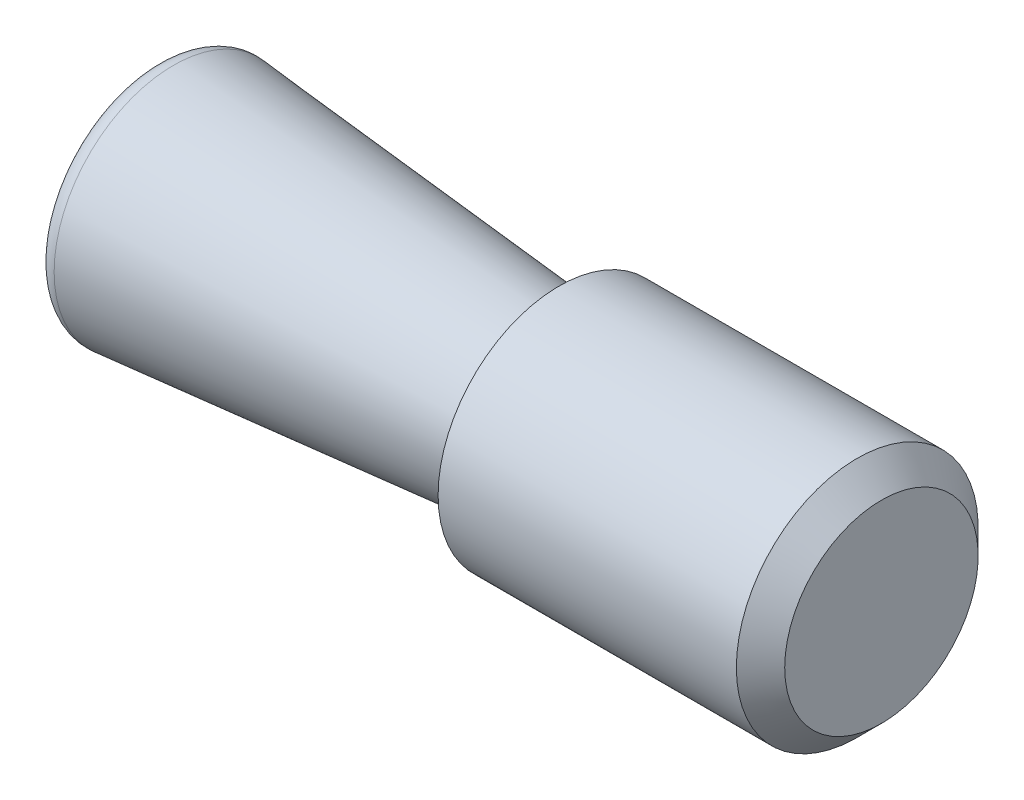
from build123d import *

# Parameters (mm, degrees)
FILLET1_R     = 0.2
CHAMFER1_SIZE = 0.3


with BuildPart() as part:
    # Sketch1 → Revolve1 (revolve)
    with BuildSketch(Plane.XY, mode=Mode.PRIVATE) as revolve1_sk:
        Polygon((0, 0), (9, 0), (9, 1.5), (5, 1.5), (5, 1.062556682), (0, 1.5), align=None)
    revolve(revolve1_sk.sketch.rotate(Axis((0, 0, 0), (1, 0, 0)), 90), axis=Axis((0, 0, 0), (1, 0, 0)))

    # Fillet1
    fillet1_edges = [part.edges().sort_by_distance(p)[0] for p in [
        (0, 0, -1.5),
    ]]
    fillet(fillet1_edges, radius=FILLET1_R)

    # Chamfer1
    chamfer1_edges = [part.edges().sort_by_distance(p)[0] for p in [
        (9, 0, -1.5),
    ]]
    chamfer(chamfer1_edges, length=CHAMFER1_SIZE)


solid = part.part
